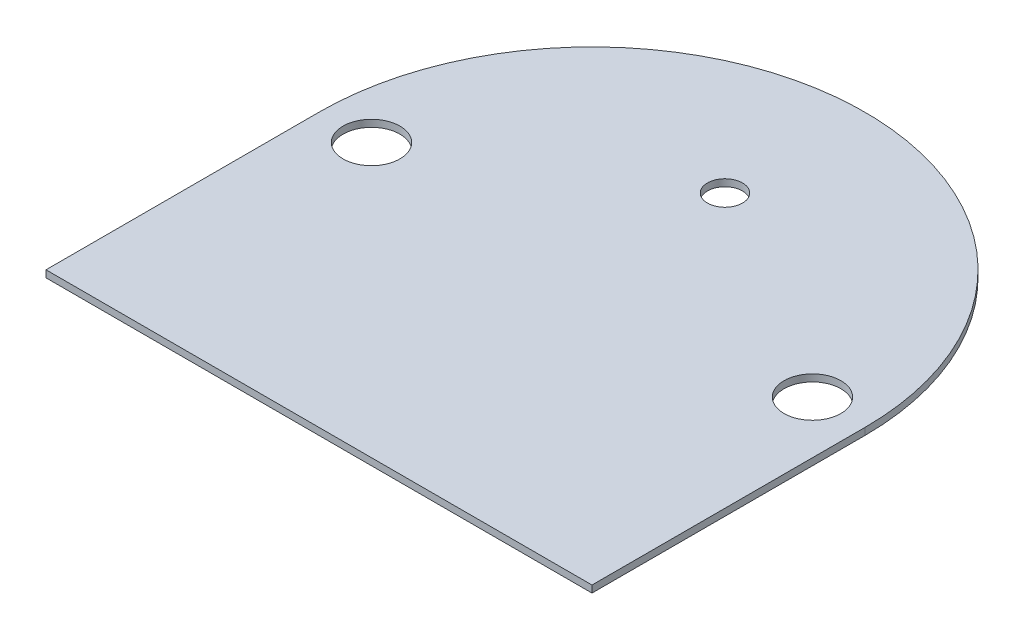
from build123d import *

# Parameters (mm, degrees)
BOSS_EXTRUDE1_DEPTH = 2.54
SKETCH2_R           = 10.31875
SKETCH2_R_2         = 6.35
CUT_EXTRUDE1_DEPTH  = 141.115019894


with BuildPart() as part:
    # Sketch1 → Boss-Extrude1 (new body)
    with BuildSketch(Plane(origin=(0, 0, 0), x_dir=(1, 0, 0), z_dir=(0, 1, 0))):
        with BuildLine():
            ThreePointArc((99.06, 0), (0, 99.06), (-99.06, 0))
            Line((-99.06, 0), (99.06, 0))
        make_face()
        with BuildLine():
            Line((99.06, 0), (-99.06, 0))
            ThreePointArc((-99.06, 0), (-70.045997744, -70.045997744), (0, -99.06))
            ThreePointArc((0, -99.06), (70.045997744, -70.045997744), (99.06, 0))
        make_face()
        with BuildLine():
            ThreePointArc((99.06, 0), (0, 99.06), (-99.06, 0))
            Line((-99.06, 0), (99.06, 0))
        make_face()
        with BuildLine():
            Line((99.06, 0), (-99.06, 0))
            ThreePointArc((-99.06, 0), (-70.045997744, -70.045997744), (0, -99.06))
            ThreePointArc((0, -99.06), (70.045997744, -70.045997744), (99.06, 0))
        make_face()
        with BuildLine():
            ThreePointArc((0, -99.06), (-70.045997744, -70.045997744), (-99.06, 0))
            Line((-99.06, 0), (-99.06, -99.06))
            Line((-99.06, -99.06), (0, -99.06))
        make_face()
        with BuildLine():
            Line((99.06, -99.06), (99.06, 0))
            ThreePointArc((99.06, 0), (70.045997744, -70.045997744), (0, -99.06))
            Line((0, -99.06), (99.06, -99.06))
        make_face()
    extrude(amount=BOSS_EXTRUDE1_DEPTH)

    # Sketch2 → Cut-Extrude1 (cut, through all)
    with BuildSketch(Plane(origin=(0, 2.54, 0), x_dir=(1, 0, 0), z_dir=(0, 1, 0))):
        with Locations(Location((-80.01, 0, 0), (0, 0, 270))):
            Circle(SKETCH2_R)
        with Locations(Location((80.01, 0, 0), (0, 0, 90))):
            Circle(SKETCH2_R)
        with Locations(Location((0, 48.26, 0), (0, 0, 270))):
            Circle(SKETCH2_R_2)
    extrude(amount=-CUT_EXTRUDE1_DEPTH, mode=Mode.SUBTRACT)


solid = part.part
